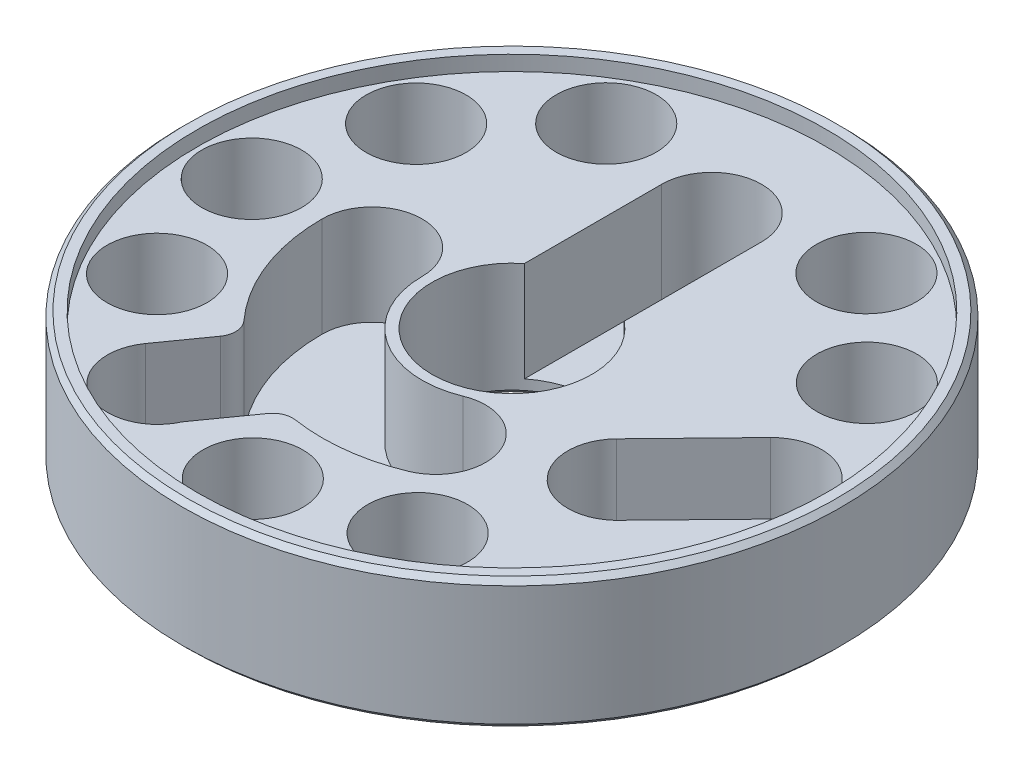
ISO-10303-21;
HEADER;
FILE_DESCRIPTION(('STEP AP214'),'2;1');
FILE_NAME('part.step','',(''),(''),'','','');
FILE_SCHEMA(('AUTOMOTIVE_DESIGN { 1 0 10303 214 1 1 1 1 }'));
ENDSEC;
DATA;
#1=APPLICATION_CONTEXT('core data for automotive mechanical design processes');
#2=APPLICATION_PROTOCOL_DEFINITION('international standard','automotive_design',2000,#1);
#3=PRODUCT_CONTEXT('',#1,'mechanical');
#4=PRODUCT('Part','Part','',(#3));
#5=PRODUCT_RELATED_PRODUCT_CATEGORY('part','',(#4));
#6=PRODUCT_DEFINITION_FORMATION('','',#4);
#7=PRODUCT_DEFINITION_CONTEXT('part definition',#1,'design');
#8=PRODUCT_DEFINITION('design','',#6,#7);
#9=PRODUCT_DEFINITION_SHAPE('','',#8);
#10=(LENGTH_UNIT() NAMED_UNIT(*) SI_UNIT(.MILLI.,.METRE.));
#11=(NAMED_UNIT(*) PLANE_ANGLE_UNIT() SI_UNIT($,.RADIAN.));
#12=(NAMED_UNIT(*) SI_UNIT($,.STERADIAN.) SOLID_ANGLE_UNIT());
#13=UNCERTAINTY_MEASURE_WITH_UNIT(LENGTH_MEASURE(1.E-05),#10,'distance_accuracy_value','');
#14=(GEOMETRIC_REPRESENTATION_CONTEXT(3) GLOBAL_UNCERTAINTY_ASSIGNED_CONTEXT((#13)) GLOBAL_UNIT_ASSIGNED_CONTEXT((#10,
#11,#12)) REPRESENTATION_CONTEXT('',''));
#15=CARTESIAN_POINT('',(0.,0.,0.));
#16=DIRECTION('',(0.,0.,1.));
#17=DIRECTION('',(1.,0.,0.));
#18=AXIS2_PLACEMENT_3D('',#15,#16,#17);
#19=CARTESIAN_POINT('',(0.,-1.5,0.));
#20=DIRECTION('',(0.,1.,0.));
#21=DIRECTION('',(0.,0.,1.));
#22=AXIS2_PLACEMENT_3D('',#19,#20,#21);
#23=PLANE('',#22);
#24=CARTESIAN_POINT('',(0.,-1.5,0.));
#25=DIRECTION('',(0.,1.,0.));
#26=DIRECTION('',(0.,0.,1.));
#27=AXIS2_PLACEMENT_3D('',#24,#25,#26);
#28=CIRCLE('',#27,31.5);
#29=CARTESIAN_POINT('',(0.,-1.5,31.5));
#30=VERTEX_POINT('',#29);
#31=EDGE_CURVE('E280',#30,#30,#28,.T.);
#32=ORIENTED_EDGE('',*,*,#31,.T.);
#33=EDGE_LOOP('',(#32));
#34=FACE_BOUND('',#33,.T.);
#35=DIRECTION('',(0.,0.,-1.));
#36=VECTOR('',#35,1.);
#37=CARTESIAN_POINT('',(5.,-1.5,-20.));
#38=LINE('',#37,#36);
#39=CARTESIAN_POINT('',(5.,-1.5,-6.2449979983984));
#40=VERTEX_POINT('',#39);
#41=CARTESIAN_POINT('',(5.,-1.5,-20.));
#42=VERTEX_POINT('',#41);
#43=EDGE_CURVE('E245',#40,#42,#38,.T.);
#44=ORIENTED_EDGE('',*,*,#43,.F.);
#45=CARTESIAN_POINT('',(0.,-1.5,0.));
#46=DIRECTION('',(0.,1.,0.));
#47=DIRECTION('',(0.,0.,1.));
#48=AXIS2_PLACEMENT_3D('',#45,#46,#47);
#49=CIRCLE('',#48,8.);
#50=CARTESIAN_POINT('',(-5.,-1.5,-6.2449979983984));
#51=VERTEX_POINT('',#50);
#52=EDGE_CURVE('E283',#40,#51,#49,.F.);
#53=ORIENTED_EDGE('',*,*,#52,.T.);
#54=DIRECTION('',(0.,0.,1.));
#55=VECTOR('',#54,1.);
#56=CARTESIAN_POINT('',(-5.,-1.5,-20.));
#57=LINE('',#56,#55);
#58=CARTESIAN_POINT('',(-5.,-1.5,-20.));
#59=VERTEX_POINT('',#58);
#60=EDGE_CURVE('E233',#59,#51,#57,.T.);
#61=ORIENTED_EDGE('',*,*,#60,.F.);
#62=CARTESIAN_POINT('',(0.,-1.5,-20.));
#63=DIRECTION('',(0.,1.,0.));
#64=DIRECTION('',(0.,0.,1.));
#65=AXIS2_PLACEMENT_3D('',#62,#63,#64);
#66=CIRCLE('',#65,5.);
#67=EDGE_CURVE('E271',#42,#59,#66,.T.);
#68=ORIENTED_EDGE('',*,*,#67,.F.);
#69=EDGE_LOOP('',(#44,#53,#61,#68));
#70=FACE_BOUND('',#69,.T.);
#71=DIRECTION('',(-0.696542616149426,0.,0.717515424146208));
#72=VECTOR('',#71,1.);
#73=CARTESIAN_POINT('',(14.8225199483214,-1.5,4.33190948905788));
#74=LINE('',#73,#72);
#75=CARTESIAN_POINT('',(22.4105180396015,-1.5,-3.48456224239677));
#76=VERTEX_POINT('',#75);
#77=CARTESIAN_POINT('',(14.8225199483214,-1.5,4.33190948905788));
#78=VERTEX_POINT('',#77);
#79=EDGE_CURVE('E238',#76,#78,#74,.T.);
#80=ORIENTED_EDGE('',*,*,#79,.F.);
#81=DIRECTION('',(-0.717515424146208,0.,-0.696542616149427));
#82=VECTOR('',#81,1.);
#83=CARTESIAN_POINT('',(22.4105180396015,-1.5,-3.48456224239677));
#84=LINE('',#83,#82);
#85=CARTESIAN_POINT('',(22.412422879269,-1.5,-3.48271308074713));
#86=VERTEX_POINT('',#85);
#87=EDGE_CURVE('E322',#86,#76,#84,.T.);
#88=ORIENTED_EDGE('',*,*,#87,.F.);
#89=CARTESIAN_POINT('',(26.,-1.5,0.));
#90=DIRECTION('',(0.,1.,0.));
#91=DIRECTION('',(0.,0.,1.));
#92=AXIS2_PLACEMENT_3D('',#89,#90,#91);
#93=CIRCLE('',#92,5.);
#94=CARTESIAN_POINT('',(29.587577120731,-1.5,3.48271308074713));
#95=VERTEX_POINT('',#94);
#96=EDGE_CURVE('E261',#95,#86,#93,.T.);
#97=ORIENTED_EDGE('',*,*,#96,.F.);
#98=CARTESIAN_POINT('',(29.5894819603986,-1.5,3.48456224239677));
#99=VERTEX_POINT('',#98);
#100=EDGE_CURVE('E329',#99,#95,#84,.T.);
#101=ORIENTED_EDGE('',*,*,#100,.F.);
#102=DIRECTION('',(0.697254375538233,0.,-0.716823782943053));
#103=VECTOR('',#102,1.);
#104=CARTESIAN_POINT('',(29.5894819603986,-1.5,3.48456224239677));
#105=LINE('',#104,#103);
#106=CARTESIAN_POINT('',(22.1538133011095,-1.5,11.1289232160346));
#107=VERTEX_POINT('',#106);
#108=EDGE_CURVE('E330',#107,#99,#105,.T.);
#109=ORIENTED_EDGE('',*,*,#108,.F.);
#110=CARTESIAN_POINT('',(18.410097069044,-1.5,7.81462256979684));
#111=DIRECTION('',(0.,1.,0.));
#112=DIRECTION('',(0.,0.,1.));
#113=AXIS2_PLACEMENT_3D('',#110,#111,#112);
#114=CIRCLE('',#113,4.99999999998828);
#115=EDGE_CURVE('E265',#78,#107,#114,.T.);
#116=ORIENTED_EDGE('',*,*,#115,.F.);
#117=EDGE_LOOP('',(#80,#88,#97,#101,#109,#116));
#118=FACE_BOUND('',#117,.T.);
#119=CARTESIAN_POINT('',(-13.0478258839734,-1.5,-22.4889804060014));
#120=DIRECTION('',(0.,1.,0.));
#121=DIRECTION('',(0.,0.,1.));
#122=AXIS2_PLACEMENT_3D('',#119,#120,#121);
#123=CIRCLE('',#122,5.);
#124=CARTESIAN_POINT('',(-13.0478258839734,-1.5,-17.4889804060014));
#125=VERTEX_POINT('',#124);
#126=EDGE_CURVE('E350',#125,#125,#123,.T.);
#127=ORIENTED_EDGE('',*,*,#126,.F.);
#128=EDGE_LOOP('',(#127));
#129=FACE_BOUND('',#128,.T.);
#130=CARTESIAN_POINT('',(-22.5442388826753,-1.5,-12.9521153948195));
#131=DIRECTION('',(0.,1.,0.));
#132=DIRECTION('',(0.,0.,1.));
#133=AXIS2_PLACEMENT_3D('',#130,#131,#132);
#134=CIRCLE('',#133,4.99999999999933);
#135=CARTESIAN_POINT('',(-22.5442388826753,-1.5,-7.95211539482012));
#136=VERTEX_POINT('',#135);
#137=EDGE_CURVE('E356',#136,#136,#134,.T.);
#138=ORIENTED_EDGE('',*,*,#137,.F.);
#139=EDGE_LOOP('',(#138));
#140=FACE_BOUND('',#139,.T.);
#141=CARTESIAN_POINT('',(-25.9999412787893,-1.5,0.0552584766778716));
#142=DIRECTION('',(0.,1.,0.));
#143=DIRECTION('',(0.,0.,1.));
#144=AXIS2_PLACEMENT_3D('',#141,#142,#143);
#145=CIRCLE('',#144,5.00000000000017);
#146=CARTESIAN_POINT('',(-25.9999412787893,-1.5,5.05525847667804));
#147=VERTEX_POINT('',#146);
#148=EDGE_CURVE('E362',#147,#147,#145,.T.);
#149=ORIENTED_EDGE('',*,*,#148,.F.);
#150=EDGE_LOOP('',(#149));
#151=FACE_BOUND('',#150,.T.);
#152=CARTESIAN_POINT('',(-22.4889804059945,-1.5,13.0478258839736));
#153=DIRECTION('',(0.,1.,0.));
#154=DIRECTION('',(0.,0.,1.));
#155=AXIS2_PLACEMENT_3D('',#152,#153,#154);
#156=CIRCLE('',#155,5.00000000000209);
#157=CARTESIAN_POINT('',(-22.4889804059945,-1.5,18.0478258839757));
#158=VERTEX_POINT('',#157);
#159=EDGE_CURVE('E368',#158,#158,#156,.T.);
#160=ORIENTED_EDGE('',*,*,#159,.F.);
#161=EDGE_LOOP('',(#160));
#162=FACE_BOUND('',#161,.T.);
#163=CARTESIAN_POINT('',(0.0552584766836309,-1.5,25.9999412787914));
#164=DIRECTION('',(0.,1.,0.));
#165=DIRECTION('',(0.,0.,1.));
#166=AXIS2_PLACEMENT_3D('',#163,#164,#165);
#167=CIRCLE('',#166,5.00000000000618);
#168=CARTESIAN_POINT('',(0.0552584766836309,-1.5,30.9999412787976));
#169=VERTEX_POINT('',#168);
#170=EDGE_CURVE('E374',#169,#169,#167,.T.);
#171=ORIENTED_EDGE('',*,*,#170,.F.);
#172=EDGE_LOOP('',(#171));
#173=FACE_BOUND('',#172,.T.);
#174=CARTESIAN_POINT('',(13.0478258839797,-1.5,22.4889804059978));
#175=DIRECTION('',(0.,1.,0.));
#176=DIRECTION('',(0.,0.,1.));
#177=AXIS2_PLACEMENT_3D('',#174,#175,#176);
#178=CIRCLE('',#177,5.00000000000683);
#179=CARTESIAN_POINT('',(13.0478258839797,-1.5,27.4889804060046));
#180=VERTEX_POINT('',#179);
#181=EDGE_CURVE('E380',#180,#180,#178,.T.);
#182=ORIENTED_EDGE('',*,*,#181,.F.);
#183=EDGE_LOOP('',(#182));
#184=FACE_BOUND('',#183,.T.);
#185=CARTESIAN_POINT('',(22.488980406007,-1.5,-13.0478258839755));
#186=DIRECTION('',(0.,1.,0.));
#187=DIRECTION('',(0.,0.,1.));
#188=AXIS2_PLACEMENT_3D('',#185,#186,#187);
#189=CIRCLE('',#188,5.00000000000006);
#190=CARTESIAN_POINT('',(22.488980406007,-1.5,-8.04782588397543));
#191=VERTEX_POINT('',#190);
#192=EDGE_CURVE('E386',#191,#191,#189,.T.);
#193=ORIENTED_EDGE('',*,*,#192,.F.);
#194=EDGE_LOOP('',(#193));
#195=FACE_BOUND('',#194,.T.);
#196=CARTESIAN_POINT('',(12.9521153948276,-1.5,-22.5442388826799));
#197=DIRECTION('',(0.,1.,0.));
#198=DIRECTION('',(0.,0.,1.));
#199=AXIS2_PLACEMENT_3D('',#196,#197,#198);
#200=CIRCLE('',#199,4.99999999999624);
#201=CARTESIAN_POINT('',(12.9521153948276,-1.5,-17.5442388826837));
#202=VERTEX_POINT('',#201);
#203=EDGE_CURVE('E392',#202,#202,#200,.T.);
#204=ORIENTED_EDGE('',*,*,#203,.F.);
#205=EDGE_LOOP('',(#204));
#206=FACE_BOUND('',#205,.T.);
#207=DIRECTION('',(0.57922372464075,0.,-0.815168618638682));
#208=VECTOR('',#207,1.);
#209=CARTESIAN_POINT('',(-2.03792154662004,-1.5,-1.44805931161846));
#210=LINE('',#209,#208);
#211=CARTESIAN_POINT('',(-17.0279584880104,-1.5,19.64812025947));
#212=VERTEX_POINT('',#211);
#213=CARTESIAN_POINT('',(-13.9190695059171,-1.5,15.2728354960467));
#214=VERTEX_POINT('',#213);
#215=EDGE_CURVE('E433',#212,#214,#210,.T.);
#216=ORIENTED_EDGE('',*,*,#215,.T.);
#217=CARTESIAN_POINT('',(-15.5494067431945,-1.5,14.1143880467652));
#218=DIRECTION('',(0.,1.,0.));
#219=DIRECTION('',(0.,0.,1.));
#220=AXIS2_PLACEMENT_3D('',#217,#218,#219);
#221=CIRCLE('',#220,2.);
#222=CARTESIAN_POINT('',(-14.0685108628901,-1.5,12.77016061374));
#223=VERTEX_POINT('',#222);
#224=EDGE_CURVE('E61',#214,#223,#221,.T.);
#225=ORIENTED_EDGE('',*,*,#224,.T.);
#226=CARTESIAN_POINT('',(5.11223008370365E-12,-1.5,-2.94902990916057E-12));
#227=DIRECTION('',(0.,1.,0.));
#228=DIRECTION('',(0.,0.,1.));
#229=AXIS2_PLACEMENT_3D('',#226,#227,#228);
#230=CIRCLE('',#229,19.0000000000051);
#231=CARTESIAN_POINT('',(-19.,-1.5,1.05157294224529E-12));
#232=VERTEX_POINT('',#231);
#233=EDGE_CURVE('E412',#232,#223,#230,.T.);
#234=ORIENTED_EDGE('',*,*,#233,.F.);
#235=CARTESIAN_POINT('',(-14.,-1.5,0.));
#236=DIRECTION('',(0.,1.,0.));
#237=DIRECTION('',(0.,0.,1.));
#238=AXIS2_PLACEMENT_3D('',#235,#236,#237);
#239=CIRCLE('',#238,5.);
#240=CARTESIAN_POINT('',(-9.,-1.5,-1.05329548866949E-12));
#241=VERTEX_POINT('',#240);
#242=EDGE_CURVE('E415',#241,#232,#239,.T.);
#243=ORIENTED_EDGE('',*,*,#242,.F.);
#244=CARTESIAN_POINT('',(5.11223008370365E-12,-1.5,-2.94902990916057E-12));
#245=DIRECTION('',(0.,1.,0.));
#246=DIRECTION('',(0.,0.,1.));
#247=AXIS2_PLACEMENT_3D('',#244,#245,#246);
#248=CIRCLE('',#247,9.00000000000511);
#249=CARTESIAN_POINT('',(3.41639149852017,-1.5,8.32635989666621));
#250=VERTEX_POINT('',#249);
#251=EDGE_CURVE('E418',#241,#250,#248,.T.);
#252=ORIENTED_EDGE('',*,*,#251,.T.);
#253=CARTESIAN_POINT('',(5.31438677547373,-1.5,12.9521153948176));
#254=DIRECTION('',(0.,1.,0.));
#255=DIRECTION('',(0.,0.,1.));
#256=AXIS2_PLACEMENT_3D('',#253,#254,#255);
#257=CIRCLE('',#256,5.00000000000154);
#258=CARTESIAN_POINT('',(7.21238205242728,-1.5,17.5778708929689));
#259=VERTEX_POINT('',#258);
#260=EDGE_CURVE('E421',#259,#250,#257,.T.);
#261=ORIENTED_EDGE('',*,*,#260,.F.);
#262=CARTESIAN_POINT('',(5.11223008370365E-12,-1.5,-2.94902990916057E-12));
#263=DIRECTION('',(0.,1.,0.));
#264=DIRECTION('',(0.,0.,1.));
#265=AXIS2_PLACEMENT_3D('',#262,#263,#264);
#266=CIRCLE('',#265,19.0000000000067);
#267=CARTESIAN_POINT('',(-2.90080388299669,-1.5,18.7772558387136));
#268=VERTEX_POINT('',#267);
#269=EDGE_CURVE('E424',#268,#259,#266,.T.);
#270=ORIENTED_EDGE('',*,*,#269,.F.);
#271=CARTESIAN_POINT('',(-3.20615166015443,-1.5,20.7538090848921));
#272=DIRECTION('',(0.,1.,0.));
#273=DIRECTION('',(0.,0.,1.));
#274=AXIS2_PLACEMENT_3D('',#271,#272,#273);
#275=CIRCLE('',#274,2.);
#276=CARTESIAN_POINT('',(-4.83648889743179,-1.5,19.5953616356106));
#277=VERTEX_POINT('',#276);
#278=EDGE_CURVE('E427',#277,#268,#275,.F.);
#279=ORIENTED_EDGE('',*,*,#278,.F.);
#280=DIRECTION('',(0.579223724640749,0.,-0.815168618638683));
#281=VECTOR('',#280,1.);
#282=CARTESIAN_POINT('',(6.03839771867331,-1.5,4.29062544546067));
#283=LINE('',#282,#281);
#284=CARTESIAN_POINT('',(-8.39727395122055,-1.5,24.6066208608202));
#285=VERTEX_POINT('',#284);
#286=EDGE_CURVE('E430',#285,#277,#283,.T.);
#287=ORIENTED_EDGE('',*,*,#286,.F.);
#288=CARTESIAN_POINT('',(-12.9521153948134,-1.5,22.5442388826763));
#289=DIRECTION('',(0.,1.,0.));
#290=DIRECTION('',(0.,0.,1.));
#291=AXIS2_PLACEMENT_3D('',#288,#289,#290);
#292=CIRCLE('',#291,5.00000000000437);
#293=EDGE_CURVE('E201',#212,#285,#292,.T.);
#294=ORIENTED_EDGE('',*,*,#293,.F.);
#295=EDGE_LOOP('',(#216,#225,#234,#243,#252,#261,#270,#279,#287,#294));
#296=FACE_BOUND('',#295,.T.);
#297=ADVANCED_FACE('F44',(#34,#70,#118,#129,#140,#151,#162,#173,#184,#195,#206,#296),#23,.T.);
#298=CARTESIAN_POINT('',(18.410097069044,-13.,7.81462256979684));
#299=DIRECTION('',(0.,1.,0.));
#300=DIRECTION('',(0.,0.,1.));
#301=AXIS2_PLACEMENT_3D('',#298,#299,#300);
#302=CYLINDRICAL_SURFACE('',#301,4.99999999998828);
#303=DIRECTION('',(0.,1.,0.));
#304=VECTOR('',#303,1.);
#305=CARTESIAN_POINT('',(22.1538133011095,-13.,11.1289232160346));
#306=LINE('',#305,#304);
#307=CARTESIAN_POINT('',(22.1538133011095,-11.5,11.1289232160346));
#308=VERTEX_POINT('',#307);
#309=EDGE_CURVE('E12',#107,#308,#306,.F.);
#310=ORIENTED_EDGE('',*,*,#309,.T.);
#311=CARTESIAN_POINT('',(18.410097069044,-11.5,7.81462256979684));
#312=DIRECTION('',(0.,1.,0.));
#313=DIRECTION('',(0.,0.,1.));
#314=AXIS2_PLACEMENT_3D('',#311,#312,#313);
#315=CIRCLE('',#314,4.99999999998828);
#316=CARTESIAN_POINT('',(14.8225199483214,-11.5,4.33190948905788));
#317=VERTEX_POINT('',#316);
#318=EDGE_CURVE('E231',#317,#308,#315,.F.);
#319=ORIENTED_EDGE('',*,*,#318,.F.);
#320=DIRECTION('',(0.,1.,0.));
#321=VECTOR('',#320,1.);
#322=CARTESIAN_POINT('',(14.8225199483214,-11.5,4.33190948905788));
#323=LINE('',#322,#321);
#324=EDGE_CURVE('E234',#317,#78,#323,.T.);
#325=ORIENTED_EDGE('',*,*,#324,.T.);
#326=ORIENTED_EDGE('',*,*,#115,.T.);
#327=EDGE_LOOP('',(#310,#319,#325,#326));
#328=FACE_BOUND('',#327,.T.);
#329=CARTESIAN_POINT('',(18.410097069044,-13.,7.81462256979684));
#330=DIRECTION('',(0.,1.,0.));
#331=DIRECTION('',(0.,0.,1.));
#332=AXIS2_PLACEMENT_3D('',#329,#330,#331);
#333=CIRCLE('',#332,4.99999999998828);
#334=CARTESIAN_POINT('',(18.410097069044,-13.,12.8146225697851));
#335=VERTEX_POINT('',#334);
#336=EDGE_CURVE('E268',#335,#335,#333,.T.);
#337=ORIENTED_EDGE('',*,*,#336,.F.);
#338=EDGE_LOOP('',(#337));
#339=FACE_BOUND('',#338,.T.);
#340=ADVANCED_FACE('F469',(#328,#339),#302,.F.);
#341=CARTESIAN_POINT('',(0.,-13.,-20.));
#342=DIRECTION('',(0.,1.,0.));
#343=DIRECTION('',(0.,0.,1.));
#344=AXIS2_PLACEMENT_3D('',#341,#342,#343);
#345=CYLINDRICAL_SURFACE('',#344,5.);
#346=CARTESIAN_POINT('',(0.,-13.,-20.));
#347=DIRECTION('',(0.,1.,0.));
#348=DIRECTION('',(0.,0.,1.));
#349=AXIS2_PLACEMENT_3D('',#346,#347,#348);
#350=CIRCLE('',#349,5.);
#351=CARTESIAN_POINT('',(0.,-13.,-15.));
#352=VERTEX_POINT('',#351);
#353=EDGE_CURVE('E274',#352,#352,#350,.T.);
#354=ORIENTED_EDGE('',*,*,#353,.F.);
#355=EDGE_LOOP('',(#354));
#356=FACE_BOUND('',#355,.T.);
#357=DIRECTION('',(0.,1.,0.));
#358=VECTOR('',#357,1.);
#359=CARTESIAN_POINT('',(5.,-11.5,-20.));
#360=LINE('',#359,#358);
#361=CARTESIAN_POINT('',(5.,-11.5,-20.));
#362=VERTEX_POINT('',#361);
#363=EDGE_CURVE('E250',#362,#42,#360,.T.);
#364=ORIENTED_EDGE('',*,*,#363,.T.);
#365=ORIENTED_EDGE('',*,*,#67,.T.);
#366=DIRECTION('',(0.,1.,0.));
#367=VECTOR('',#366,1.);
#368=CARTESIAN_POINT('',(-5.,-11.5,-20.));
#369=LINE('',#368,#367);
#370=CARTESIAN_POINT('',(-5.,-11.5,-20.));
#371=VERTEX_POINT('',#370);
#372=EDGE_CURVE('E247',#371,#59,#369,.T.);
#373=ORIENTED_EDGE('',*,*,#372,.F.);
#374=CARTESIAN_POINT('',(0.,-11.5,-20.));
#375=DIRECTION('',(0.,1.,0.));
#376=DIRECTION('',(0.,0.,1.));
#377=AXIS2_PLACEMENT_3D('',#374,#375,#376);
#378=CIRCLE('',#377,5.);
#379=EDGE_CURVE('E306',#362,#371,#378,.F.);
#380=ORIENTED_EDGE('',*,*,#379,.F.);
#381=EDGE_LOOP('',(#364,#365,#373,#380));
#382=FACE_BOUND('',#381,.T.);
#383=ADVANCED_FACE('F475',(#356,#382),#345,.F.);
#384=CARTESIAN_POINT('',(0.,-13.,0.));
#385=DIRECTION('',(0.,1.,0.));
#386=DIRECTION('',(0.,0.,1.));
#387=AXIS2_PLACEMENT_3D('',#384,#385,#386);
#388=CYLINDRICAL_SURFACE('',#387,8.);
#389=ORIENTED_EDGE('',*,*,#52,.F.);
#390=DIRECTION('',(0.,1.,0.));
#391=VECTOR('',#390,1.);
#392=CARTESIAN_POINT('',(5.,-11.5,-6.2449979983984));
#393=LINE('',#392,#391);
#394=CARTESIAN_POINT('',(5.,-11.5,-6.2449979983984));
#395=VERTEX_POINT('',#394);
#396=EDGE_CURVE('E254',#395,#40,#393,.T.);
#397=ORIENTED_EDGE('',*,*,#396,.F.);
#398=CARTESIAN_POINT('',(0.,-11.5,0.));
#399=DIRECTION('',(0.,1.,0.));
#400=DIRECTION('',(0.,0.,1.));
#401=AXIS2_PLACEMENT_3D('',#398,#399,#400);
#402=CIRCLE('',#401,8.);
#403=CARTESIAN_POINT('',(-5.,-11.5,-6.2449979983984));
#404=VERTEX_POINT('',#403);
#405=EDGE_CURVE('E253',#404,#395,#402,.F.);
#406=ORIENTED_EDGE('',*,*,#405,.F.);
#407=DIRECTION('',(0.,1.,0.));
#408=VECTOR('',#407,1.);
#409=CARTESIAN_POINT('',(-5.,-11.5,-6.2449979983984));
#410=LINE('',#409,#408);
#411=EDGE_CURVE('E256',#404,#51,#410,.T.);
#412=ORIENTED_EDGE('',*,*,#411,.T.);
#413=EDGE_LOOP('',(#389,#397,#406,#412));
#414=FACE_BOUND('',#413,.T.);
#415=CARTESIAN_POINT('',(0.,-12.5,0.));
#416=DIRECTION('',(0.,1.,0.));
#417=DIRECTION('',(0.,0.,1.));
#418=AXIS2_PLACEMENT_3D('',#415,#416,#417);
#419=CIRCLE('',#418,8.);
#420=CARTESIAN_POINT('',(0.,-12.5,8.));
#421=VERTEX_POINT('',#420);
#422=EDGE_CURVE('E294',#421,#421,#419,.F.);
#423=ORIENTED_EDGE('',*,*,#422,.T.);
#424=EDGE_LOOP('',(#423));
#425=FACE_BOUND('',#424,.T.);
#426=ADVANCED_FACE('F487',(#414,#425),#388,.F.);
#427=CARTESIAN_POINT('',(0.,-13.,0.));
#428=DIRECTION('',(0.,1.,0.));
#429=DIRECTION('',(0.,0.,1.));
#430=AXIS2_PLACEMENT_3D('',#427,#428,#429);
#431=CYLINDRICAL_SURFACE('',#430,33.);
#432=CARTESIAN_POINT('',(0.,-12.5,0.));
#433=DIRECTION('',(0.,1.,0.));
#434=DIRECTION('',(0.,0.,1.));
#435=AXIS2_PLACEMENT_3D('',#432,#433,#434);
#436=CIRCLE('',#435,33.);
#437=CARTESIAN_POINT('',(0.,-12.5,33.));
#438=VERTEX_POINT('',#437);
#439=EDGE_CURVE('E300',#438,#438,#436,.T.);
#440=CARTESIAN_POINT('',(0.,-0.499999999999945,0.));
#441=DIRECTION('',(0.,1.,0.));
#442=DIRECTION('',(0.,0.,1.));
#443=AXIS2_PLACEMENT_3D('',#440,#441,#442);
#444=CIRCLE('',#443,33.);
#445=CARTESIAN_POINT('',(0.,-0.499999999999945,33.));
#446=VERTEX_POINT('',#445);
#447=EDGE_CURVE('E297',#446,#446,#444,.F.);
#448=CARTESIAN_POINT('',(0.,-12.5,33.));
#449=CARTESIAN_POINT('',(0.,-12.375,33.));
#450=CARTESIAN_POINT('',(0.,-12.25,33.));
#451=CARTESIAN_POINT('',(0.,-12.,33.));
#452=CARTESIAN_POINT('',(0.,-11.875,33.));
#453=CARTESIAN_POINT('',(0.,-11.625,33.));
#454=CARTESIAN_POINT('',(0.,-11.5,33.));
#455=CARTESIAN_POINT('',(0.,-11.25,33.));
#456=CARTESIAN_POINT('',(0.,-11.125,33.));
#457=CARTESIAN_POINT('',(0.,-10.875,33.));
#458=CARTESIAN_POINT('',(0.,-10.75,33.));
#459=CARTESIAN_POINT('',(0.,-10.5,33.));
#460=CARTESIAN_POINT('',(0.,-10.375,33.));
#461=CARTESIAN_POINT('',(0.,-10.125,33.));
#462=CARTESIAN_POINT('',(0.,-9.99999999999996,33.));
#463=CARTESIAN_POINT('',(0.,-9.74999999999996,33.));
#464=CARTESIAN_POINT('',(0.,-9.62499999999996,33.));
#465=CARTESIAN_POINT('',(0.,-9.37499999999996,33.));
#466=CARTESIAN_POINT('',(0.,-9.24999999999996,33.));
#467=CARTESIAN_POINT('',(0.,-8.99999999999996,33.));
#468=CARTESIAN_POINT('',(0.,-8.87499999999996,33.));
#469=CARTESIAN_POINT('',(0.,-8.62499999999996,33.));
#470=CARTESIAN_POINT('',(0.,-8.49999999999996,33.));
#471=CARTESIAN_POINT('',(0.,-8.24999999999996,33.));
#472=CARTESIAN_POINT('',(0.,-8.12499999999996,33.));
#473=CARTESIAN_POINT('',(0.,-7.87499999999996,33.));
#474=CARTESIAN_POINT('',(0.,-7.74999999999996,33.));
#475=CARTESIAN_POINT('',(0.,-7.49999999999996,33.));
#476=CARTESIAN_POINT('',(0.,-7.37499999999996,33.));
#477=CARTESIAN_POINT('',(0.,-7.12499999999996,33.));
#478=CARTESIAN_POINT('',(0.,-6.99999999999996,33.));
#479=CARTESIAN_POINT('',(0.,-6.74999999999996,33.));
#480=CARTESIAN_POINT('',(0.,-6.62499999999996,33.));
#481=CARTESIAN_POINT('',(0.,-6.37499999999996,33.));
#482=CARTESIAN_POINT('',(0.,-6.24999999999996,33.));
#483=CARTESIAN_POINT('',(0.,-5.99999999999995,33.));
#484=CARTESIAN_POINT('',(0.,-5.87499999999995,33.));
#485=CARTESIAN_POINT('',(0.,-5.62499999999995,33.));
#486=CARTESIAN_POINT('',(0.,-5.49999999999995,33.));
#487=CARTESIAN_POINT('',(0.,-5.24999999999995,33.));
#488=CARTESIAN_POINT('',(0.,-5.12499999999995,33.));
#489=CARTESIAN_POINT('',(0.,-4.87499999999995,33.));
#490=CARTESIAN_POINT('',(0.,-4.74999999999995,33.));
#491=CARTESIAN_POINT('',(0.,-4.49999999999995,33.));
#492=CARTESIAN_POINT('',(0.,-4.37499999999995,33.));
#493=CARTESIAN_POINT('',(0.,-4.12499999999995,33.));
#494=CARTESIAN_POINT('',(0.,-3.99999999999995,33.));
#495=CARTESIAN_POINT('',(0.,-3.74999999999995,33.));
#496=CARTESIAN_POINT('',(0.,-3.62499999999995,33.));
#497=CARTESIAN_POINT('',(0.,-3.37499999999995,33.));
#498=CARTESIAN_POINT('',(0.,-3.24999999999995,33.));
#499=CARTESIAN_POINT('',(0.,-2.99999999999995,33.));
#500=CARTESIAN_POINT('',(0.,-2.87499999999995,33.));
#501=CARTESIAN_POINT('',(0.,-2.62499999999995,33.));
#502=CARTESIAN_POINT('',(0.,-2.49999999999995,33.));
#503=CARTESIAN_POINT('',(0.,-2.24999999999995,33.));
#504=CARTESIAN_POINT('',(0.,-2.12499999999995,33.));
#505=CARTESIAN_POINT('',(0.,-1.87499999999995,33.));
#506=CARTESIAN_POINT('',(0.,-1.74999999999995,33.));
#507=CARTESIAN_POINT('',(0.,-1.49999999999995,33.));
#508=CARTESIAN_POINT('',(0.,-1.37499999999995,33.));
#509=CARTESIAN_POINT('',(0.,-1.12499999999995,33.));
#510=CARTESIAN_POINT('',(0.,-0.999999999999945,33.));
#511=CARTESIAN_POINT('',(0.,-0.749999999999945,33.));
#512=CARTESIAN_POINT('',(0.,-0.624999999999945,33.));
#513=CARTESIAN_POINT('',(0.,-0.499999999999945,33.));
#514=B_SPLINE_CURVE_WITH_KNOTS('',3,(#448,#449,#450,#451,#452,#453,#454,#455,#456,#457,#458,
#459,#460,#461,#462,#463,#464,#465,#466,#467,#468,#469,#470,#471,#472,#473,#474,#475,#476,#477,
#478,#479,#480,#481,#482,#483,#484,#485,#486,#487,#488,#489,#490,#491,#492,#493,#494,#495,#496,
#497,#498,#499,#500,#501,#502,#503,#504,#505,#506,#507,#508,#509,#510,#511,#512,#513),
.UNSPECIFIED.,.F.,.F.,(4,2,2,2,2,2,2,2,2,2,2,2,2,2,2,2,2,2,2,2,2,2,2,2,2,2,2,2,2,2,2,2,4),(0.,
0.375,0.750000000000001,1.125,1.5,1.875,2.25,2.625,3.,3.375,3.75,4.12500000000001,
4.50000000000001,4.87500000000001,5.25000000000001,5.62500000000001,6.00000000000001,
6.37500000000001,6.75000000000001,7.12500000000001,7.50000000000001,7.87500000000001,
8.25000000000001,8.62500000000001,9.00000000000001,9.37500000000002,9.75000000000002,10.125,
10.5,10.875,11.25,11.625,12.),.UNSPECIFIED.);
#515=EDGE_CURVE('BSEAM490',#438,#446,#514,.T.);
#516=ORIENTED_EDGE('',*,*,#439,.T.);
#517=ORIENTED_EDGE('',*,*,#447,.T.);
#518=ORIENTED_EDGE('',*,*,#515,.T.);
#519=ORIENTED_EDGE('',*,*,#515,.F.);
#520=EDGE_LOOP('',(#516,#518,#517,#519));
#521=FACE_BOUND('',#520,.T.);
#522=ADVANCED_FACE('F490',(#521),#431,.T.);
#523=CARTESIAN_POINT('',(0.,-13.,0.));
#524=DIRECTION('',(0.,1.,0.));
#525=DIRECTION('',(0.,0.,1.));
#526=AXIS2_PLACEMENT_3D('',#523,#524,#525);
#527=PLANE('',#526);
#528=CARTESIAN_POINT('',(-12.9521153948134,-13.,22.5442388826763));
#529=DIRECTION('',(0.,1.,0.));
#530=DIRECTION('',(0.,0.,1.));
#531=AXIS2_PLACEMENT_3D('',#528,#529,#530);
#532=CIRCLE('',#531,5.);
#533=CARTESIAN_POINT('',(-12.9521153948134,-13.,27.5442388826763));
#534=VERTEX_POINT('',#533);
#535=EDGE_CURVE('E194',#534,#534,#532,.T.);
#536=ORIENTED_EDGE('',*,*,#535,.T.);
#537=EDGE_LOOP('',(#536));
#538=FACE_BOUND('',#537,.T.);
#539=CARTESIAN_POINT('',(12.9521153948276,-13.,-22.5442388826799));
#540=DIRECTION('',(0.,1.,0.));
#541=DIRECTION('',(0.,0.,1.));
#542=AXIS2_PLACEMENT_3D('',#539,#540,#541);
#543=CIRCLE('',#542,4.99999999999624);
#544=CARTESIAN_POINT('',(12.9521153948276,-13.,-17.5442388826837));
#545=VERTEX_POINT('',#544);
#546=EDGE_CURVE('E389',#545,#545,#543,.T.);
#547=ORIENTED_EDGE('',*,*,#546,.T.);
#548=EDGE_LOOP('',(#547));
#549=FACE_BOUND('',#548,.T.);
#550=CARTESIAN_POINT('',(22.488980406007,-13.,-13.0478258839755));
#551=DIRECTION('',(0.,1.,0.));
#552=DIRECTION('',(0.,0.,1.));
#553=AXIS2_PLACEMENT_3D('',#550,#551,#552);
#554=CIRCLE('',#553,5.00000000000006);
#555=CARTESIAN_POINT('',(22.488980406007,-13.,-8.04782588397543));
#556=VERTEX_POINT('',#555);
#557=EDGE_CURVE('E383',#556,#556,#554,.T.);
#558=ORIENTED_EDGE('',*,*,#557,.T.);
#559=EDGE_LOOP('',(#558));
#560=FACE_BOUND('',#559,.T.);
#561=CARTESIAN_POINT('',(13.0478258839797,-13.,22.4889804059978));
#562=DIRECTION('',(0.,1.,0.));
#563=DIRECTION('',(0.,0.,1.));
#564=AXIS2_PLACEMENT_3D('',#561,#562,#563);
#565=CIRCLE('',#564,5.00000000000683);
#566=CARTESIAN_POINT('',(13.0478258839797,-13.,27.4889804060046));
#567=VERTEX_POINT('',#566);
#568=EDGE_CURVE('E377',#567,#567,#565,.T.);
#569=ORIENTED_EDGE('',*,*,#568,.T.);
#570=EDGE_LOOP('',(#569));
#571=FACE_BOUND('',#570,.T.);
#572=CARTESIAN_POINT('',(0.0552584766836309,-13.,25.9999412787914));
#573=DIRECTION('',(0.,1.,0.));
#574=DIRECTION('',(0.,0.,1.));
#575=AXIS2_PLACEMENT_3D('',#572,#573,#574);
#576=CIRCLE('',#575,5.00000000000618);
#577=CARTESIAN_POINT('',(0.0552584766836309,-13.,30.9999412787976));
#578=VERTEX_POINT('',#577);
#579=EDGE_CURVE('E371',#578,#578,#576,.T.);
#580=ORIENTED_EDGE('',*,*,#579,.T.);
#581=EDGE_LOOP('',(#580));
#582=FACE_BOUND('',#581,.T.);
#583=CARTESIAN_POINT('',(-22.4889804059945,-13.,13.0478258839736));
#584=DIRECTION('',(0.,1.,0.));
#585=DIRECTION('',(0.,0.,1.));
#586=AXIS2_PLACEMENT_3D('',#583,#584,#585);
#587=CIRCLE('',#586,5.00000000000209);
#588=CARTESIAN_POINT('',(-22.4889804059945,-13.,18.0478258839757));
#589=VERTEX_POINT('',#588);
#590=EDGE_CURVE('E365',#589,#589,#587,.T.);
#591=ORIENTED_EDGE('',*,*,#590,.T.);
#592=EDGE_LOOP('',(#591));
#593=FACE_BOUND('',#592,.T.);
#594=CARTESIAN_POINT('',(-25.9999412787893,-13.,0.0552584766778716));
#595=DIRECTION('',(0.,1.,0.));
#596=DIRECTION('',(0.,0.,1.));
#597=AXIS2_PLACEMENT_3D('',#594,#595,#596);
#598=CIRCLE('',#597,5.00000000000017);
#599=CARTESIAN_POINT('',(-25.9999412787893,-13.,5.05525847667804));
#600=VERTEX_POINT('',#599);
#601=EDGE_CURVE('E359',#600,#600,#598,.T.);
#602=ORIENTED_EDGE('',*,*,#601,.T.);
#603=EDGE_LOOP('',(#602));
#604=FACE_BOUND('',#603,.T.);
#605=CARTESIAN_POINT('',(-22.5442388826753,-13.,-12.9521153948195));
#606=DIRECTION('',(0.,1.,0.));
#607=DIRECTION('',(0.,0.,1.));
#608=AXIS2_PLACEMENT_3D('',#605,#606,#607);
#609=CIRCLE('',#608,4.99999999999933);
#610=CARTESIAN_POINT('',(-22.5442388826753,-13.,-7.95211539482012));
#611=VERTEX_POINT('',#610);
#612=EDGE_CURVE('E353',#611,#611,#609,.T.);
#613=ORIENTED_EDGE('',*,*,#612,.T.);
#614=EDGE_LOOP('',(#613));
#615=FACE_BOUND('',#614,.T.);
#616=CARTESIAN_POINT('',(-13.0478258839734,-13.,-22.4889804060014));
#617=DIRECTION('',(0.,1.,0.));
#618=DIRECTION('',(0.,0.,1.));
#619=AXIS2_PLACEMENT_3D('',#616,#617,#618);
#620=CIRCLE('',#619,5.);
#621=CARTESIAN_POINT('',(-13.0478258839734,-13.,-17.4889804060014));
#622=VERTEX_POINT('',#621);
#623=EDGE_CURVE('E332',#622,#622,#620,.T.);
#624=ORIENTED_EDGE('',*,*,#623,.T.);
#625=EDGE_LOOP('',(#624));
#626=FACE_BOUND('',#625,.T.);
#627=CARTESIAN_POINT('',(26.,-13.,0.));
#628=DIRECTION('',(0.,1.,0.));
#629=DIRECTION('',(0.,0.,1.));
#630=AXIS2_PLACEMENT_3D('',#627,#628,#629);
#631=CIRCLE('',#630,5.);
#632=CARTESIAN_POINT('',(26.,-13.,5.));
#633=VERTEX_POINT('',#632);
#634=EDGE_CURVE('E262',#633,#633,#631,.T.);
#635=ORIENTED_EDGE('',*,*,#634,.T.);
#636=EDGE_LOOP('',(#635));
#637=FACE_BOUND('',#636,.T.);
#638=ORIENTED_EDGE('',*,*,#336,.T.);
#639=EDGE_LOOP('',(#638));
#640=FACE_BOUND('',#639,.T.);
#641=ORIENTED_EDGE('',*,*,#353,.T.);
#642=EDGE_LOOP('',(#641));
#643=FACE_BOUND('',#642,.T.);
#644=CARTESIAN_POINT('',(0.,-13.,0.));
#645=DIRECTION('',(0.,1.,0.));
#646=DIRECTION('',(0.,0.,1.));
#647=AXIS2_PLACEMENT_3D('',#644,#645,#646);
#648=CIRCLE('',#647,8.49999999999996);
#649=CARTESIAN_POINT('',(0.,-13.,8.49999999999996));
#650=VERTEX_POINT('',#649);
#651=EDGE_CURVE('E291',#650,#650,#648,.T.);
#652=ORIENTED_EDGE('',*,*,#651,.T.);
#653=EDGE_LOOP('',(#652));
#654=FACE_BOUND('',#653,.T.);
#655=CARTESIAN_POINT('',(0.,-13.,0.));
#656=DIRECTION('',(0.,1.,0.));
#657=DIRECTION('',(0.,0.,1.));
#658=AXIS2_PLACEMENT_3D('',#655,#656,#657);
#659=CIRCLE('',#658,32.5);
#660=CARTESIAN_POINT('',(0.,-13.,32.5));
#661=VERTEX_POINT('',#660);
#662=EDGE_CURVE('E288',#661,#661,#659,.F.);
#663=ORIENTED_EDGE('',*,*,#662,.T.);
#664=EDGE_LOOP('',(#663));
#665=FACE_BOUND('',#664,.T.);
#666=ADVANCED_FACE('F455',(#538,#549,#560,#571,#582,#593,#604,#615,#626,#637,#640,#643,#654,
#665),#527,.F.);
#667=CARTESIAN_POINT('',(0.,0.,0.));
#668=DIRECTION('',(0.,1.,0.));
#669=DIRECTION('',(0.,0.,1.));
#670=AXIS2_PLACEMENT_3D('',#667,#668,#669);
#671=PLANE('',#670);
#672=CARTESIAN_POINT('',(0.,0.,0.));
#673=DIRECTION('',(0.,1.,0.));
#674=DIRECTION('',(0.,0.,1.));
#675=AXIS2_PLACEMENT_3D('',#672,#673,#674);
#676=CIRCLE('',#675,32.5);
#677=CARTESIAN_POINT('',(0.,0.,32.5));
#678=VERTEX_POINT('',#677);
#679=EDGE_CURVE('E303',#678,#678,#676,.T.);
#680=ORIENTED_EDGE('',*,*,#679,.T.);
#681=EDGE_LOOP('',(#680));
#682=FACE_BOUND('',#681,.T.);
#683=CARTESIAN_POINT('',(0.,0.,0.));
#684=DIRECTION('',(0.,1.,0.));
#685=DIRECTION('',(0.,0.,1.));
#686=AXIS2_PLACEMENT_3D('',#683,#684,#685);
#687=CIRCLE('',#686,31.5);
#688=CARTESIAN_POINT('',(0.,0.,31.5));
#689=VERTEX_POINT('',#688);
#690=EDGE_CURVE('E277',#689,#689,#687,.T.);
#691=ORIENTED_EDGE('',*,*,#690,.F.);
#692=EDGE_LOOP('',(#691));
#693=FACE_BOUND('',#692,.T.);
#694=ADVANCED_FACE('F485',(#682,#693),#671,.T.);
#695=CARTESIAN_POINT('',(0.,-1.5,0.));
#696=DIRECTION('',(0.,1.,0.));
#697=DIRECTION('',(0.,0.,1.));
#698=AXIS2_PLACEMENT_3D('',#695,#696,#697);
#699=CYLINDRICAL_SURFACE('',#698,31.5);
#700=ORIENTED_EDGE('',*,*,#31,.F.);
#701=EDGE_LOOP('',(#700));
#702=FACE_BOUND('',#701,.T.);
#703=ORIENTED_EDGE('',*,*,#690,.T.);
#704=EDGE_LOOP('',(#703));
#705=FACE_BOUND('',#704,.T.);
#706=ADVANCED_FACE('F481',(#702,#705),#699,.F.);
#707=CARTESIAN_POINT('',(0.,-13.,0.));
#708=DIRECTION('',(0.,-1.,0.));
#709=DIRECTION('',(0.,0.,-1.));
#710=AXIS2_PLACEMENT_3D('',#707,#708,#709);
#711=CONICAL_SURFACE('',#710,8.49999999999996,0.785398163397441);
#712=ORIENTED_EDGE('',*,*,#422,.F.);
#713=EDGE_LOOP('',(#712));
#714=FACE_BOUND('',#713,.T.);
#715=ORIENTED_EDGE('',*,*,#651,.F.);
#716=EDGE_LOOP('',(#715));
#717=FACE_BOUND('',#716,.T.);
#718=ADVANCED_FACE('F484',(#714,#717),#711,.F.);
#719=CARTESIAN_POINT('',(0.,-12.5,0.));
#720=DIRECTION('',(0.,1.,0.));
#721=DIRECTION('',(0.,0.,1.));
#722=AXIS2_PLACEMENT_3D('',#719,#720,#721);
#723=CONICAL_SURFACE('',#722,33.,0.785398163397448);
#724=ORIENTED_EDGE('',*,*,#662,.F.);
#725=EDGE_LOOP('',(#724));
#726=FACE_BOUND('',#725,.T.);
#727=ORIENTED_EDGE('',*,*,#439,.F.);
#728=EDGE_LOOP('',(#727));
#729=FACE_BOUND('',#728,.T.);
#730=ADVANCED_FACE('F501',(#726,#729),#723,.T.);
#731=CARTESIAN_POINT('',(0.,0.,0.));
#732=DIRECTION('',(0.,-1.,0.));
#733=DIRECTION('',(0.,0.,-1.));
#734=AXIS2_PLACEMENT_3D('',#731,#732,#733);
#735=CONICAL_SURFACE('',#734,32.5,0.785398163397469);
#736=ORIENTED_EDGE('',*,*,#447,.F.);
#737=EDGE_LOOP('',(#736));
#738=FACE_BOUND('',#737,.T.);
#739=ORIENTED_EDGE('',*,*,#679,.F.);
#740=EDGE_LOOP('',(#739));
#741=FACE_BOUND('',#740,.T.);
#742=ADVANCED_FACE('F46',(#738,#741),#735,.T.);
#743=CARTESIAN_POINT('',(26.,-13.,0.));
#744=DIRECTION('',(0.,1.,0.));
#745=DIRECTION('',(0.,0.,1.));
#746=AXIS2_PLACEMENT_3D('',#743,#744,#745);
#747=CYLINDRICAL_SURFACE('',#746,5.);
#748=ORIENTED_EDGE('',*,*,#96,.T.);
#749=DIRECTION('',(0.,1.,0.));
#750=VECTOR('',#749,1.);
#751=CARTESIAN_POINT('',(22.412422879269,-13.,-3.48271308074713));
#752=LINE('',#751,#750);
#753=CARTESIAN_POINT('',(22.412422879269,-11.5,-3.48271308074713));
#754=VERTEX_POINT('',#753);
#755=EDGE_CURVE('E53',#86,#754,#752,.F.);
#756=ORIENTED_EDGE('',*,*,#755,.T.);
#757=CARTESIAN_POINT('',(26.,-11.5,0.));
#758=DIRECTION('',(0.,1.,0.));
#759=DIRECTION('',(0.,0.,1.));
#760=AXIS2_PLACEMENT_3D('',#757,#758,#759);
#761=CIRCLE('',#760,5.);
#762=CARTESIAN_POINT('',(29.587577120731,-11.5,3.48271308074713));
#763=VERTEX_POINT('',#762);
#764=EDGE_CURVE('E308',#763,#754,#761,.F.);
#765=ORIENTED_EDGE('',*,*,#764,.F.);
#766=DIRECTION('',(0.,1.,0.));
#767=VECTOR('',#766,1.);
#768=CARTESIAN_POINT('',(29.587577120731,-13.,3.48271308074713));
#769=LINE('',#768,#767);
#770=EDGE_CURVE('E309',#763,#95,#769,.T.);
#771=ORIENTED_EDGE('',*,*,#770,.T.);
#772=EDGE_LOOP('',(#748,#756,#765,#771));
#773=FACE_BOUND('',#772,.T.);
#774=ORIENTED_EDGE('',*,*,#634,.F.);
#775=EDGE_LOOP('',(#774));
#776=FACE_BOUND('',#775,.T.);
#777=ADVANCED_FACE('F315',(#773,#776),#747,.F.);
#778=CARTESIAN_POINT('',(0.,-11.5,0.));
#779=DIRECTION('',(0.,1.,0.));
#780=DIRECTION('',(0.,0.,1.));
#781=AXIS2_PLACEMENT_3D('',#778,#779,#780);
#782=PLANE('',#781);
#783=ORIENTED_EDGE('',*,*,#405,.T.);
#784=DIRECTION('',(0.,0.,-1.));
#785=VECTOR('',#784,1.);
#786=CARTESIAN_POINT('',(5.,-11.5,-20.));
#787=LINE('',#786,#785);
#788=EDGE_CURVE('E244',#395,#362,#787,.T.);
#789=ORIENTED_EDGE('',*,*,#788,.T.);
#790=ORIENTED_EDGE('',*,*,#379,.T.);
#791=DIRECTION('',(0.,0.,1.));
#792=VECTOR('',#791,1.);
#793=CARTESIAN_POINT('',(-5.,-11.5,-20.));
#794=LINE('',#793,#792);
#795=EDGE_CURVE('E241',#371,#404,#794,.T.);
#796=ORIENTED_EDGE('',*,*,#795,.T.);
#797=EDGE_LOOP('',(#783,#789,#790,#796));
#798=FACE_BOUND('',#797,.T.);
#799=ADVANCED_FACE('F523',(#798),#782,.T.);
#800=CARTESIAN_POINT('',(5.,-11.5,-20.));
#801=DIRECTION('',(1.,0.,0.));
#802=DIRECTION('',(0.,0.,-1.));
#803=AXIS2_PLACEMENT_3D('',#800,#801,#802);
#804=PLANE('',#803);
#805=ORIENTED_EDGE('',*,*,#43,.T.);
#806=ORIENTED_EDGE('',*,*,#363,.F.);
#807=ORIENTED_EDGE('',*,*,#788,.F.);
#808=ORIENTED_EDGE('',*,*,#396,.T.);
#809=EDGE_LOOP('',(#805,#806,#807,#808));
#810=FACE_BOUND('',#809,.T.);
#811=ADVANCED_FACE('F528',(#810),#804,.F.);
#812=CARTESIAN_POINT('',(-5.,-11.5,-20.));
#813=DIRECTION('',(-1.,0.,0.));
#814=DIRECTION('',(0.,0.,1.));
#815=AXIS2_PLACEMENT_3D('',#812,#813,#814);
#816=PLANE('',#815);
#817=ORIENTED_EDGE('',*,*,#60,.T.);
#818=ORIENTED_EDGE('',*,*,#411,.F.);
#819=ORIENTED_EDGE('',*,*,#795,.F.);
#820=ORIENTED_EDGE('',*,*,#372,.T.);
#821=EDGE_LOOP('',(#817,#818,#819,#820));
#822=FACE_BOUND('',#821,.T.);
#823=ADVANCED_FACE('F532',(#822),#816,.F.);
#824=CARTESIAN_POINT('',(29.5894819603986,-11.5,3.48456224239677));
#825=DIRECTION('',(0.716823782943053,0.,0.697254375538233));
#826=DIRECTION('',(0.697254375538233,0.,-0.716823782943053));
#827=AXIS2_PLACEMENT_3D('',#824,#825,#826);
#828=PLANE('',#827);
#829=ORIENTED_EDGE('',*,*,#108,.T.);
#830=DIRECTION('',(0.,1.,0.));
#831=VECTOR('',#830,1.);
#832=CARTESIAN_POINT('',(29.5894819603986,-11.5,3.48456224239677));
#833=LINE('',#832,#831);
#834=CARTESIAN_POINT('',(29.5894819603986,-11.5,3.48456224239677));
#835=VERTEX_POINT('',#834);
#836=EDGE_CURVE('E340',#835,#99,#833,.T.);
#837=ORIENTED_EDGE('',*,*,#836,.F.);
#838=DIRECTION('',(0.697254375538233,0.,-0.716823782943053));
#839=VECTOR('',#838,1.);
#840=CARTESIAN_POINT('',(29.5894819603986,-11.5,3.48456224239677));
#841=LINE('',#840,#839);
#842=EDGE_CURVE('E235',#308,#835,#841,.T.);
#843=ORIENTED_EDGE('',*,*,#842,.F.);
#844=ORIENTED_EDGE('',*,*,#309,.F.);
#845=EDGE_LOOP('',(#829,#837,#843,#844));
#846=FACE_BOUND('',#845,.T.);
#847=ADVANCED_FACE('F535',(#846),#828,.F.);
#848=CARTESIAN_POINT('',(22.4105180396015,-11.5,-3.48456224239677));
#849=DIRECTION('',(0.696542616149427,0.,-0.717515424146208));
#850=DIRECTION('',(-0.717515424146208,0.,-0.696542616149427));
#851=AXIS2_PLACEMENT_3D('',#848,#849,#850);
#852=PLANE('',#851);
#853=ORIENTED_EDGE('',*,*,#87,.T.);
#854=DIRECTION('',(0.,1.,0.));
#855=VECTOR('',#854,1.);
#856=CARTESIAN_POINT('',(22.4105180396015,-11.5,-3.48456224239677));
#857=LINE('',#856,#855);
#858=CARTESIAN_POINT('',(22.4105180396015,-11.5,-3.48456224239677));
#859=VERTEX_POINT('',#858);
#860=EDGE_CURVE('E339',#859,#76,#857,.T.);
#861=ORIENTED_EDGE('',*,*,#860,.F.);
#862=DIRECTION('',(-0.717515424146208,0.,-0.696542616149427));
#863=VECTOR('',#862,1.);
#864=CARTESIAN_POINT('',(22.4105180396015,-11.5,-3.48456224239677));
#865=LINE('',#864,#863);
#866=EDGE_CURVE('E237',#754,#859,#865,.T.);
#867=ORIENTED_EDGE('',*,*,#866,.F.);
#868=ORIENTED_EDGE('',*,*,#755,.F.);
#869=EDGE_LOOP('',(#853,#861,#867,#868));
#870=FACE_BOUND('',#869,.T.);
#871=ADVANCED_FACE('F320',(#870),#852,.F.);
#872=EDGE_CURVE('E69',#835,#763,#865,.T.);
#873=ORIENTED_EDGE('',*,*,#872,.F.);
#874=ORIENTED_EDGE('',*,*,#836,.T.);
#875=ORIENTED_EDGE('',*,*,#100,.T.);
#876=ORIENTED_EDGE('',*,*,#770,.F.);
#877=EDGE_LOOP('',(#873,#874,#875,#876));
#878=FACE_BOUND('',#877,.T.);
#879=ADVANCED_FACE('F545',(#878),#852,.F.);
#880=CARTESIAN_POINT('',(0.,-11.5,0.));
#881=DIRECTION('',(0.,1.,0.));
#882=DIRECTION('',(0.,0.,1.));
#883=AXIS2_PLACEMENT_3D('',#880,#881,#882);
#884=PLANE('',#883);
#885=ORIENTED_EDGE('',*,*,#318,.T.);
#886=ORIENTED_EDGE('',*,*,#842,.T.);
#887=ORIENTED_EDGE('',*,*,#872,.T.);
#888=ORIENTED_EDGE('',*,*,#764,.T.);
#889=ORIENTED_EDGE('',*,*,#866,.T.);
#890=DIRECTION('',(-0.696542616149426,0.,0.717515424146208));
#891=VECTOR('',#890,1.);
#892=CARTESIAN_POINT('',(14.8225199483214,-11.5,4.33190948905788));
#893=LINE('',#892,#891);
#894=EDGE_CURVE('E342',#859,#317,#893,.T.);
#895=ORIENTED_EDGE('',*,*,#894,.T.);
#896=EDGE_LOOP('',(#885,#886,#887,#888,#889,#895));
#897=FACE_BOUND('',#896,.T.);
#898=ADVANCED_FACE('F550',(#897),#884,.T.);
#899=CARTESIAN_POINT('',(14.8225199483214,-11.5,4.33190948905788));
#900=DIRECTION('',(-0.717515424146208,0.,-0.696542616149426));
#901=DIRECTION('',(-0.696542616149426,0.,0.717515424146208));
#902=AXIS2_PLACEMENT_3D('',#899,#900,#901);
#903=PLANE('',#902);
#904=ORIENTED_EDGE('',*,*,#79,.T.);
#905=ORIENTED_EDGE('',*,*,#324,.F.);
#906=ORIENTED_EDGE('',*,*,#894,.F.);
#907=ORIENTED_EDGE('',*,*,#860,.T.);
#908=EDGE_LOOP('',(#904,#905,#906,#907));
#909=FACE_BOUND('',#908,.T.);
#910=ADVANCED_FACE('F546',(#909),#903,.F.);
#911=CARTESIAN_POINT('',(-13.0478258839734,-13.,-22.4889804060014));
#912=DIRECTION('',(0.,1.,0.));
#913=DIRECTION('',(0.,0.,1.));
#914=AXIS2_PLACEMENT_3D('',#911,#912,#913);
#915=CYLINDRICAL_SURFACE('',#914,5.);
#916=ORIENTED_EDGE('',*,*,#623,.F.);
#917=EDGE_LOOP('',(#916));
#918=FACE_BOUND('',#917,.T.);
#919=ORIENTED_EDGE('',*,*,#126,.T.);
#920=EDGE_LOOP('',(#919));
#921=FACE_BOUND('',#920,.T.);
#922=ADVANCED_FACE('F549',(#918,#921),#915,.F.);
#923=CARTESIAN_POINT('',(-22.5442388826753,-13.,-12.9521153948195));
#924=DIRECTION('',(0.,1.,0.));
#925=DIRECTION('',(0.,0.,1.));
#926=AXIS2_PLACEMENT_3D('',#923,#924,#925);
#927=CYLINDRICAL_SURFACE('',#926,4.99999999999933);
#928=ORIENTED_EDGE('',*,*,#612,.F.);
#929=EDGE_LOOP('',(#928));
#930=FACE_BOUND('',#929,.T.);
#931=ORIENTED_EDGE('',*,*,#137,.T.);
#932=EDGE_LOOP('',(#931));
#933=FACE_BOUND('',#932,.T.);
#934=ADVANCED_FACE('F556',(#930,#933),#927,.F.);
#935=CARTESIAN_POINT('',(-25.9999412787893,-13.,0.0552584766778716));
#936=DIRECTION('',(0.,1.,0.));
#937=DIRECTION('',(0.,0.,1.));
#938=AXIS2_PLACEMENT_3D('',#935,#936,#937);
#939=CYLINDRICAL_SURFACE('',#938,5.00000000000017);
#940=ORIENTED_EDGE('',*,*,#601,.F.);
#941=EDGE_LOOP('',(#940));
#942=FACE_BOUND('',#941,.T.);
#943=ORIENTED_EDGE('',*,*,#148,.T.);
#944=EDGE_LOOP('',(#943));
#945=FACE_BOUND('',#944,.T.);
#946=ADVANCED_FACE('F560',(#942,#945),#939,.F.);
#947=CARTESIAN_POINT('',(-22.4889804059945,-13.,13.0478258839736));
#948=DIRECTION('',(0.,1.,0.));
#949=DIRECTION('',(0.,0.,1.));
#950=AXIS2_PLACEMENT_3D('',#947,#948,#949);
#951=CYLINDRICAL_SURFACE('',#950,5.00000000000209);
#952=ORIENTED_EDGE('',*,*,#590,.F.);
#953=EDGE_LOOP('',(#952));
#954=FACE_BOUND('',#953,.T.);
#955=ORIENTED_EDGE('',*,*,#159,.T.);
#956=EDGE_LOOP('',(#955));
#957=FACE_BOUND('',#956,.T.);
#958=ADVANCED_FACE('F564',(#954,#957),#951,.F.);
#959=CARTESIAN_POINT('',(0.0552584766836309,-13.,25.9999412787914));
#960=DIRECTION('',(0.,1.,0.));
#961=DIRECTION('',(0.,0.,1.));
#962=AXIS2_PLACEMENT_3D('',#959,#960,#961);
#963=CYLINDRICAL_SURFACE('',#962,5.00000000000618);
#964=ORIENTED_EDGE('',*,*,#579,.F.);
#965=EDGE_LOOP('',(#964));
#966=FACE_BOUND('',#965,.T.);
#967=ORIENTED_EDGE('',*,*,#170,.T.);
#968=EDGE_LOOP('',(#967));
#969=FACE_BOUND('',#968,.T.);
#970=ADVANCED_FACE('F568',(#966,#969),#963,.F.);
#971=CARTESIAN_POINT('',(13.0478258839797,-13.,22.4889804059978));
#972=DIRECTION('',(0.,1.,0.));
#973=DIRECTION('',(0.,0.,1.));
#974=AXIS2_PLACEMENT_3D('',#971,#972,#973);
#975=CYLINDRICAL_SURFACE('',#974,5.00000000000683);
#976=ORIENTED_EDGE('',*,*,#568,.F.);
#977=EDGE_LOOP('',(#976));
#978=FACE_BOUND('',#977,.T.);
#979=ORIENTED_EDGE('',*,*,#181,.T.);
#980=EDGE_LOOP('',(#979));
#981=FACE_BOUND('',#980,.T.);
#982=ADVANCED_FACE('F572',(#978,#981),#975,.F.);
#983=CARTESIAN_POINT('',(22.488980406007,-13.,-13.0478258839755));
#984=DIRECTION('',(0.,1.,0.));
#985=DIRECTION('',(0.,0.,1.));
#986=AXIS2_PLACEMENT_3D('',#983,#984,#985);
#987=CYLINDRICAL_SURFACE('',#986,5.00000000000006);
#988=ORIENTED_EDGE('',*,*,#557,.F.);
#989=EDGE_LOOP('',(#988));
#990=FACE_BOUND('',#989,.T.);
#991=ORIENTED_EDGE('',*,*,#192,.T.);
#992=EDGE_LOOP('',(#991));
#993=FACE_BOUND('',#992,.T.);
#994=ADVANCED_FACE('F576',(#990,#993),#987,.F.);
#995=CARTESIAN_POINT('',(12.9521153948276,-13.,-22.5442388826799));
#996=DIRECTION('',(0.,1.,0.));
#997=DIRECTION('',(0.,0.,1.));
#998=AXIS2_PLACEMENT_3D('',#995,#996,#997);
#999=CYLINDRICAL_SURFACE('',#998,4.99999999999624);
#1000=ORIENTED_EDGE('',*,*,#546,.F.);
#1001=EDGE_LOOP('',(#1000));
#1002=FACE_BOUND('',#1001,.T.);
#1003=ORIENTED_EDGE('',*,*,#203,.T.);
#1004=EDGE_LOOP('',(#1003));
#1005=FACE_BOUND('',#1004,.T.);
#1006=ADVANCED_FACE('F580',(#1002,#1005),#999,.F.);
#1007=CARTESIAN_POINT('',(-15.5494067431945,-11.5,14.1143880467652));
#1008=DIRECTION('',(0.,1.,0.));
#1009=DIRECTION('',(0.,0.,1.));
#1010=AXIS2_PLACEMENT_3D('',#1007,#1008,#1009);
#1011=CYLINDRICAL_SURFACE('',#1010,2.);
#1012=ORIENTED_EDGE('',*,*,#224,.F.);
#1013=DIRECTION('',(0.,1.,0.));
#1014=VECTOR('',#1013,1.);
#1015=CARTESIAN_POINT('',(-13.9190695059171,-11.5,15.2728354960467));
#1016=LINE('',#1015,#1014);
#1017=CARTESIAN_POINT('',(-13.9190695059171,-11.5,15.2728354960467));
#1018=VERTEX_POINT('',#1017);
#1019=EDGE_CURVE('E222',#1018,#214,#1016,.T.);
#1020=ORIENTED_EDGE('',*,*,#1019,.F.);
#1021=CARTESIAN_POINT('',(-15.5494067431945,-11.5,14.1143880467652));
#1022=DIRECTION('',(0.,1.,0.));
#1023=DIRECTION('',(0.,0.,1.));
#1024=AXIS2_PLACEMENT_3D('',#1021,#1022,#1023);
#1025=CIRCLE('',#1024,2.);
#1026=CARTESIAN_POINT('',(-14.0685108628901,-11.5,12.77016061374));
#1027=VERTEX_POINT('',#1026);
#1028=EDGE_CURVE('E213',#1018,#1027,#1025,.T.);
#1029=ORIENTED_EDGE('',*,*,#1028,.T.);
#1030=DIRECTION('',(0.,1.,0.));
#1031=VECTOR('',#1030,1.);
#1032=CARTESIAN_POINT('',(-14.0685108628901,-11.5,12.77016061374));
#1033=LINE('',#1032,#1031);
#1034=EDGE_CURVE('E395',#1027,#223,#1033,.T.);
#1035=ORIENTED_EDGE('',*,*,#1034,.T.);
#1036=EDGE_LOOP('',(#1012,#1020,#1029,#1035));
#1037=FACE_BOUND('',#1036,.T.);
#1038=ADVANCED_FACE('F584',(#1037),#1011,.T.);
#1039=CARTESIAN_POINT('',(5.11223008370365E-12,-11.5,-2.94902990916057E-12));
#1040=DIRECTION('',(0.,1.,0.));
#1041=DIRECTION('',(0.,0.,1.));
#1042=AXIS2_PLACEMENT_3D('',#1039,#1040,#1041);
#1043=CYLINDRICAL_SURFACE('',#1042,19.0000000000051);
#1044=ORIENTED_EDGE('',*,*,#233,.T.);
#1045=ORIENTED_EDGE('',*,*,#1034,.F.);
#1046=CARTESIAN_POINT('',(5.11223008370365E-12,-11.5,-2.94902990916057E-12));
#1047=DIRECTION('',(0.,1.,0.));
#1048=DIRECTION('',(0.,0.,1.));
#1049=AXIS2_PLACEMENT_3D('',#1046,#1047,#1048);
#1050=CIRCLE('',#1049,19.0000000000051);
#1051=CARTESIAN_POINT('',(-19.,-11.5,1.05157294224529E-12));
#1052=VERTEX_POINT('',#1051);
#1053=EDGE_CURVE('E399',#1052,#1027,#1050,.T.);
#1054=ORIENTED_EDGE('',*,*,#1053,.F.);
#1055=DIRECTION('',(0.,1.,0.));
#1056=VECTOR('',#1055,1.);
#1057=CARTESIAN_POINT('',(-19.,-11.5,1.05157294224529E-12));
#1058=LINE('',#1057,#1056);
#1059=EDGE_CURVE('E409',#1052,#232,#1058,.T.);
#1060=ORIENTED_EDGE('',*,*,#1059,.T.);
#1061=EDGE_LOOP('',(#1044,#1045,#1054,#1060));
#1062=FACE_BOUND('',#1061,.T.);
#1063=ADVANCED_FACE('F587',(#1062),#1043,.F.);
#1064=CARTESIAN_POINT('',(-14.,-11.5,0.));
#1065=DIRECTION('',(0.,1.,0.));
#1066=DIRECTION('',(0.,0.,1.));
#1067=AXIS2_PLACEMENT_3D('',#1064,#1065,#1066);
#1068=CYLINDRICAL_SURFACE('',#1067,5.);
#1069=ORIENTED_EDGE('',*,*,#242,.T.);
#1070=ORIENTED_EDGE('',*,*,#1059,.F.);
#1071=CARTESIAN_POINT('',(-14.,-11.5,0.));
#1072=DIRECTION('',(0.,1.,0.));
#1073=DIRECTION('',(0.,0.,1.));
#1074=AXIS2_PLACEMENT_3D('',#1071,#1072,#1073);
#1075=CIRCLE('',#1074,5.);
#1076=CARTESIAN_POINT('',(-9.,-11.5,-1.05329548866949E-12));
#1077=VERTEX_POINT('',#1076);
#1078=EDGE_CURVE('E439',#1077,#1052,#1075,.T.);
#1079=ORIENTED_EDGE('',*,*,#1078,.F.);
#1080=DIRECTION('',(0.,1.,0.));
#1081=VECTOR('',#1080,1.);
#1082=CARTESIAN_POINT('',(-9.,-11.5,-1.05329548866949E-12));
#1083=LINE('',#1082,#1081);
#1084=EDGE_CURVE('E407',#1077,#241,#1083,.T.);
#1085=ORIENTED_EDGE('',*,*,#1084,.T.);
#1086=EDGE_LOOP('',(#1069,#1070,#1079,#1085));
#1087=FACE_BOUND('',#1086,.T.);
#1088=ADVANCED_FACE('F591',(#1087),#1068,.F.);
#1089=CARTESIAN_POINT('',(5.11223008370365E-12,-11.5,-2.94902990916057E-12));
#1090=DIRECTION('',(0.,1.,0.));
#1091=DIRECTION('',(0.,0.,1.));
#1092=AXIS2_PLACEMENT_3D('',#1089,#1090,#1091);
#1093=CYLINDRICAL_SURFACE('',#1092,9.00000000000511);
#1094=ORIENTED_EDGE('',*,*,#251,.F.);
#1095=ORIENTED_EDGE('',*,*,#1084,.F.);
#1096=CARTESIAN_POINT('',(5.11223008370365E-12,-11.5,-2.94902990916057E-12));
#1097=DIRECTION('',(0.,1.,0.));
#1098=DIRECTION('',(0.,0.,1.));
#1099=AXIS2_PLACEMENT_3D('',#1096,#1097,#1098);
#1100=CIRCLE('',#1099,9.00000000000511);
#1101=CARTESIAN_POINT('',(3.41639149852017,-11.5,8.32635989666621));
#1102=VERTEX_POINT('',#1101);
#1103=EDGE_CURVE('E442',#1077,#1102,#1100,.T.);
#1104=ORIENTED_EDGE('',*,*,#1103,.T.);
#1105=DIRECTION('',(0.,1.,0.));
#1106=VECTOR('',#1105,1.);
#1107=CARTESIAN_POINT('',(3.41639149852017,-11.5,8.32635989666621));
#1108=LINE('',#1107,#1106);
#1109=EDGE_CURVE('E405',#1102,#250,#1108,.T.);
#1110=ORIENTED_EDGE('',*,*,#1109,.T.);
#1111=EDGE_LOOP('',(#1094,#1095,#1104,#1110));
#1112=FACE_BOUND('',#1111,.T.);
#1113=ADVANCED_FACE('F597',(#1112),#1093,.T.);
#1114=CARTESIAN_POINT('',(5.31438677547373,-11.5,12.9521153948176));
#1115=DIRECTION('',(0.,1.,0.));
#1116=DIRECTION('',(0.,0.,1.));
#1117=AXIS2_PLACEMENT_3D('',#1114,#1115,#1116);
#1118=CYLINDRICAL_SURFACE('',#1117,5.00000000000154);
#1119=ORIENTED_EDGE('',*,*,#260,.T.);
#1120=ORIENTED_EDGE('',*,*,#1109,.F.);
#1121=CARTESIAN_POINT('',(5.31438677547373,-11.5,12.9521153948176));
#1122=DIRECTION('',(0.,1.,0.));
#1123=DIRECTION('',(0.,0.,1.));
#1124=AXIS2_PLACEMENT_3D('',#1121,#1122,#1123);
#1125=CIRCLE('',#1124,5.00000000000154);
#1126=CARTESIAN_POINT('',(7.21238205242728,-11.5,17.5778708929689));
#1127=VERTEX_POINT('',#1126);
#1128=EDGE_CURVE('E444',#1127,#1102,#1125,.T.);
#1129=ORIENTED_EDGE('',*,*,#1128,.F.);
#1130=DIRECTION('',(0.,1.,0.));
#1131=VECTOR('',#1130,1.);
#1132=CARTESIAN_POINT('',(7.21238205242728,-11.5,17.5778708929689));
#1133=LINE('',#1132,#1131);
#1134=EDGE_CURVE('E403',#1127,#259,#1133,.T.);
#1135=ORIENTED_EDGE('',*,*,#1134,.T.);
#1136=EDGE_LOOP('',(#1119,#1120,#1129,#1135));
#1137=FACE_BOUND('',#1136,.T.);
#1138=ADVANCED_FACE('F604',(#1137),#1118,.F.);
#1139=CARTESIAN_POINT('',(5.11223008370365E-12,-11.5,-2.94902990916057E-12));
#1140=DIRECTION('',(0.,1.,0.));
#1141=DIRECTION('',(0.,0.,1.));
#1142=AXIS2_PLACEMENT_3D('',#1139,#1140,#1141);
#1143=CYLINDRICAL_SURFACE('',#1142,19.0000000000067);
#1144=ORIENTED_EDGE('',*,*,#269,.T.);
#1145=ORIENTED_EDGE('',*,*,#1134,.F.);
#1146=CARTESIAN_POINT('',(5.11223008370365E-12,-11.5,-2.94902990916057E-12));
#1147=DIRECTION('',(0.,1.,0.));
#1148=DIRECTION('',(0.,0.,1.));
#1149=AXIS2_PLACEMENT_3D('',#1146,#1147,#1148);
#1150=CIRCLE('',#1149,19.0000000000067);
#1151=CARTESIAN_POINT('',(-2.90080388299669,-11.5,18.7772558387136));
#1152=VERTEX_POINT('',#1151);
#1153=EDGE_CURVE('E211',#1152,#1127,#1150,.T.);
#1154=ORIENTED_EDGE('',*,*,#1153,.F.);
#1155=DIRECTION('',(0.,1.,0.));
#1156=VECTOR('',#1155,1.);
#1157=CARTESIAN_POINT('',(-2.90080388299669,-11.5,18.7772558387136));
#1158=LINE('',#1157,#1156);
#1159=EDGE_CURVE('E401',#1152,#268,#1158,.T.);
#1160=ORIENTED_EDGE('',*,*,#1159,.T.);
#1161=EDGE_LOOP('',(#1144,#1145,#1154,#1160));
#1162=FACE_BOUND('',#1161,.T.);
#1163=ADVANCED_FACE('F608',(#1162),#1143,.F.);
#1164=CARTESIAN_POINT('',(-3.20615166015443,-11.5,20.7538090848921));
#1165=DIRECTION('',(0.,1.,0.));
#1166=DIRECTION('',(0.,0.,1.));
#1167=AXIS2_PLACEMENT_3D('',#1164,#1165,#1166);
#1168=CYLINDRICAL_SURFACE('',#1167,2.);
#1169=ORIENTED_EDGE('',*,*,#278,.T.);
#1170=ORIENTED_EDGE('',*,*,#1159,.F.);
#1171=CARTESIAN_POINT('',(-3.20615166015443,-11.5,20.7538090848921));
#1172=DIRECTION('',(0.,1.,0.));
#1173=DIRECTION('',(0.,0.,1.));
#1174=AXIS2_PLACEMENT_3D('',#1171,#1172,#1173);
#1175=CIRCLE('',#1174,2.);
#1176=CARTESIAN_POINT('',(-4.83648889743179,-11.5,19.5953616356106));
#1177=VERTEX_POINT('',#1176);
#1178=EDGE_CURVE('E210',#1177,#1152,#1175,.F.);
#1179=ORIENTED_EDGE('',*,*,#1178,.F.);
#1180=DIRECTION('',(0.,1.,0.));
#1181=VECTOR('',#1180,1.);
#1182=CARTESIAN_POINT('',(-4.83648889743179,-11.5,19.5953616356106));
#1183=LINE('',#1182,#1181);
#1184=EDGE_CURVE('E205',#1177,#277,#1183,.T.);
#1185=ORIENTED_EDGE('',*,*,#1184,.T.);
#1186=EDGE_LOOP('',(#1169,#1170,#1179,#1185));
#1187=FACE_BOUND('',#1186,.T.);
#1188=ADVANCED_FACE('F466',(#1187),#1168,.T.);
#1189=CARTESIAN_POINT('',(6.03839771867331,-11.5,4.29062544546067));
#1190=DIRECTION('',(0.815168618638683,0.,0.579223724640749));
#1191=DIRECTION('',(0.579223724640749,0.,-0.815168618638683));
#1192=AXIS2_PLACEMENT_3D('',#1189,#1190,#1191);
#1193=PLANE('',#1192);
#1194=ORIENTED_EDGE('',*,*,#286,.T.);
#1195=ORIENTED_EDGE('',*,*,#1184,.F.);
#1196=DIRECTION('',(0.579223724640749,0.,-0.815168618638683));
#1197=VECTOR('',#1196,1.);
#1198=CARTESIAN_POINT('',(6.03839771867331,-11.5,4.29062544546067));
#1199=LINE('',#1198,#1197);
#1200=CARTESIAN_POINT('',(-8.39727395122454,-11.5,24.6066208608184));
#1201=VERTEX_POINT('',#1200);
#1202=EDGE_CURVE('E189',#1201,#1177,#1199,.T.);
#1203=ORIENTED_EDGE('',*,*,#1202,.F.);
#1204=DIRECTION('',(0.,1.,0.));
#1205=VECTOR('',#1204,1.);
#1206=CARTESIAN_POINT('',(-8.39727395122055,-11.5,24.6066208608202));
#1207=LINE('',#1206,#1205);
#1208=EDGE_CURVE('E197',#1201,#285,#1207,.T.);
#1209=ORIENTED_EDGE('',*,*,#1208,.T.);
#1210=EDGE_LOOP('',(#1194,#1195,#1203,#1209));
#1211=FACE_BOUND('',#1210,.T.);
#1212=ADVANCED_FACE('F208',(#1211),#1193,.F.);
#1213=CARTESIAN_POINT('',(-12.9521153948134,-11.5,22.5442388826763));
#1214=DIRECTION('',(0.,1.,0.));
#1215=DIRECTION('',(0.,0.,1.));
#1216=AXIS2_PLACEMENT_3D('',#1213,#1214,#1215);
#1217=CYLINDRICAL_SURFACE('',#1216,5.00000000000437);
#1218=ORIENTED_EDGE('',*,*,#293,.T.);
#1219=ORIENTED_EDGE('',*,*,#1208,.F.);
#1220=CARTESIAN_POINT('',(-12.9521153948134,-11.5,22.5442388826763));
#1221=DIRECTION('',(0.,1.,0.));
#1222=DIRECTION('',(0.,0.,1.));
#1223=AXIS2_PLACEMENT_3D('',#1220,#1221,#1222);
#1224=CIRCLE('',#1223,5.);
#1225=CARTESIAN_POINT('',(-17.0279584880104,-11.5,19.64812025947));
#1226=VERTEX_POINT('',#1225);
#1227=EDGE_CURVE('E184',#1201,#1226,#1224,.T.);
#1228=ORIENTED_EDGE('',*,*,#1227,.T.);
#1229=DIRECTION('',(0.,1.,0.));
#1230=VECTOR('',#1229,1.);
#1231=CARTESIAN_POINT('',(-17.0279584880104,-11.5,19.64812025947));
#1232=LINE('',#1231,#1230);
#1233=EDGE_CURVE('E206',#1226,#212,#1232,.T.);
#1234=ORIENTED_EDGE('',*,*,#1233,.T.);
#1235=EDGE_LOOP('',(#1218,#1219,#1228,#1234));
#1236=FACE_BOUND('',#1235,.T.);
#1237=ORIENTED_EDGE('',*,*,#535,.F.);
#1238=EDGE_LOOP('',(#1237));
#1239=FACE_BOUND('',#1238,.T.);
#1240=ADVANCED_FACE('F198',(#1236,#1239),#1217,.F.);
#1241=CARTESIAN_POINT('',(-2.03792154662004,-11.5,-1.44805931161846));
#1242=DIRECTION('',(0.815168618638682,0.,0.57922372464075));
#1243=DIRECTION('',(0.57922372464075,0.,-0.815168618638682));
#1244=AXIS2_PLACEMENT_3D('',#1241,#1242,#1243);
#1245=PLANE('',#1244);
#1246=ORIENTED_EDGE('',*,*,#215,.F.);
#1247=ORIENTED_EDGE('',*,*,#1233,.F.);
#1248=DIRECTION('',(0.57922372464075,0.,-0.815168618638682));
#1249=VECTOR('',#1248,1.);
#1250=CARTESIAN_POINT('',(-2.03792154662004,-11.5,-1.44805931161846));
#1251=LINE('',#1250,#1249);
#1252=EDGE_CURVE('E191',#1226,#1018,#1251,.T.);
#1253=ORIENTED_EDGE('',*,*,#1252,.T.);
#1254=ORIENTED_EDGE('',*,*,#1019,.T.);
#1255=EDGE_LOOP('',(#1246,#1247,#1253,#1254));
#1256=FACE_BOUND('',#1255,.T.);
#1257=ADVANCED_FACE('F458',(#1256),#1245,.T.);
#1258=CARTESIAN_POINT('',(0.,-11.5,0.));
#1259=DIRECTION('',(0.,1.,0.));
#1260=DIRECTION('',(0.,0.,1.));
#1261=AXIS2_PLACEMENT_3D('',#1258,#1259,#1260);
#1262=PLANE('',#1261);
#1263=ORIENTED_EDGE('',*,*,#1227,.F.);
#1264=ORIENTED_EDGE('',*,*,#1202,.T.);
#1265=ORIENTED_EDGE('',*,*,#1178,.T.);
#1266=ORIENTED_EDGE('',*,*,#1153,.T.);
#1267=ORIENTED_EDGE('',*,*,#1128,.T.);
#1268=ORIENTED_EDGE('',*,*,#1103,.F.);
#1269=ORIENTED_EDGE('',*,*,#1078,.T.);
#1270=ORIENTED_EDGE('',*,*,#1053,.T.);
#1271=ORIENTED_EDGE('',*,*,#1028,.F.);
#1272=ORIENTED_EDGE('',*,*,#1252,.F.);
#1273=EDGE_LOOP('',(#1263,#1264,#1265,#1266,#1267,#1268,#1269,#1270,#1271,#1272));
#1274=FACE_BOUND('',#1273,.T.);
#1275=ADVANCED_FACE('F186',(#1274),#1262,.T.);
#1276=CLOSED_SHELL('',(#297,#340,#383,#426,#522,#666,#694,#706,#718,#730,#742,#777,#799,#811,
#823,#847,#871,#879,#898,#910,#922,#934,#946,#958,#970,#982,#994,#1006,#1038,#1063,#1088,#1113,
#1138,#1163,#1188,#1212,#1240,#1257,#1275));
#1277=MANIFOLD_SOLID_BREP('B2',#1276);
#1278=ADVANCED_BREP_SHAPE_REPRESENTATION('',(#18,#1277),#14);
#1279=SHAPE_DEFINITION_REPRESENTATION(#9,#1278);
ENDSEC;
END-ISO-10303-21;
